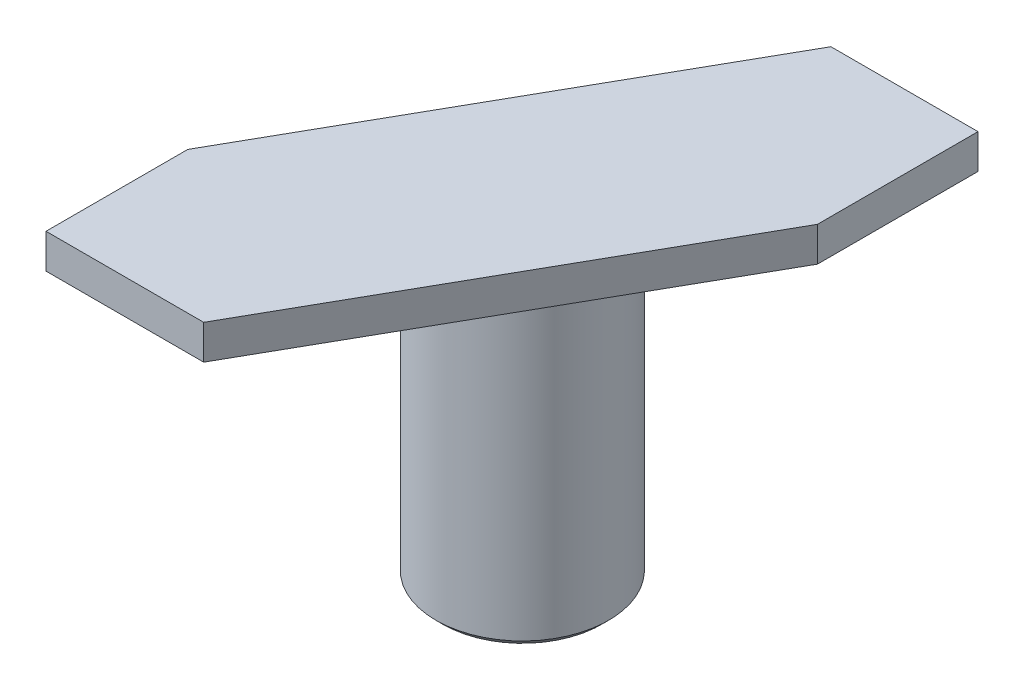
ISO-10303-21;
HEADER;
FILE_DESCRIPTION(('STEP AP214'),'2;1');
FILE_NAME('part.step','',(''),(''),'','','');
FILE_SCHEMA(('AUTOMOTIVE_DESIGN { 1 0 10303 214 1 1 1 1 }'));
ENDSEC;
DATA;
#1=APPLICATION_CONTEXT('core data for automotive mechanical design processes');
#2=APPLICATION_PROTOCOL_DEFINITION('international standard','automotive_design',2000,#1);
#3=PRODUCT_CONTEXT('',#1,'mechanical');
#4=PRODUCT('Part','Part','',(#3));
#5=PRODUCT_RELATED_PRODUCT_CATEGORY('part','',(#4));
#6=PRODUCT_DEFINITION_FORMATION('','',#4);
#7=PRODUCT_DEFINITION_CONTEXT('part definition',#1,'design');
#8=PRODUCT_DEFINITION('design','',#6,#7);
#9=PRODUCT_DEFINITION_SHAPE('','',#8);
#10=(LENGTH_UNIT() NAMED_UNIT(*) SI_UNIT(.MILLI.,.METRE.));
#11=(NAMED_UNIT(*) PLANE_ANGLE_UNIT() SI_UNIT($,.RADIAN.));
#12=(NAMED_UNIT(*) SI_UNIT($,.STERADIAN.) SOLID_ANGLE_UNIT());
#13=UNCERTAINTY_MEASURE_WITH_UNIT(LENGTH_MEASURE(1.E-05),#10,'distance_accuracy_value','');
#14=(GEOMETRIC_REPRESENTATION_CONTEXT(3) GLOBAL_UNCERTAINTY_ASSIGNED_CONTEXT((#13)) GLOBAL_UNIT_ASSIGNED_CONTEXT((#10,
#11,#12)) REPRESENTATION_CONTEXT('',''));
#15=CARTESIAN_POINT('',(0.,0.,0.));
#16=DIRECTION('',(0.,0.,1.));
#17=DIRECTION('',(1.,0.,0.));
#18=AXIS2_PLACEMENT_3D('',#15,#16,#17);
#19=CARTESIAN_POINT('',(-5.61205530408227,1.,7.24112996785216));
#20=DIRECTION('',(0.870010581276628,0.,0.493033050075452));
#21=DIRECTION('',(0.493033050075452,0.,-0.870010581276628));
#22=AXIS2_PLACEMENT_3D('',#19,#20,#21);
#23=PLANE('',#22);
#24=DIRECTION('',(-0.493033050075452,0.,0.870010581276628));
#25=VECTOR('',#24,1.);
#26=CARTESIAN_POINT('',(-5.61205530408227,0.,7.24112996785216));
#27=LINE('',#26,#25);
#28=CARTESIAN_POINT('',(1.1272308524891,0.,-4.6510753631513));
#29=VERTEX_POINT('',#28);
#30=CARTESIAN_POINT('',(-5.61205530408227,0.,7.24112996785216));
#31=VERTEX_POINT('',#30);
#32=EDGE_CURVE('E145',#29,#31,#27,.T.);
#33=ORIENTED_EDGE('',*,*,#32,.T.);
#34=DIRECTION('',(0.,-1.,0.));
#35=VECTOR('',#34,1.);
#36=CARTESIAN_POINT('',(-5.61205530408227,1.,7.24112996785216));
#37=LINE('',#36,#35);
#38=CARTESIAN_POINT('',(-5.61205530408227,1.,7.24112996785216));
#39=VERTEX_POINT('',#38);
#40=EDGE_CURVE('E174',#39,#31,#37,.T.);
#41=ORIENTED_EDGE('',*,*,#40,.F.);
#42=DIRECTION('',(-0.493033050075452,0.,0.870010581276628));
#43=VECTOR('',#42,1.);
#44=CARTESIAN_POINT('',(-5.61205530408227,1.,7.24112996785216));
#45=LINE('',#44,#43);
#46=CARTESIAN_POINT('',(1.1272308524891,1.,-4.6510753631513));
#47=VERTEX_POINT('',#46);
#48=EDGE_CURVE('E163',#47,#39,#45,.T.);
#49=ORIENTED_EDGE('',*,*,#48,.F.);
#50=DIRECTION('',(0.,-1.,0.));
#51=VECTOR('',#50,1.);
#52=CARTESIAN_POINT('',(1.1272308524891,1.,-4.6510753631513));
#53=LINE('',#52,#51);
#54=EDGE_CURVE('E141',#47,#29,#53,.T.);
#55=ORIENTED_EDGE('',*,*,#54,.T.);
#56=EDGE_LOOP('',(#33,#41,#49,#55));
#57=FACE_BOUND('',#56,.T.);
#58=ADVANCED_FACE('F41',(#57),#23,.F.);
#59=CARTESIAN_POINT('',(-5.61205530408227,1.,11.3489246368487));
#60=DIRECTION('',(1.,0.,0.));
#61=DIRECTION('',(0.,0.,-1.));
#62=AXIS2_PLACEMENT_3D('',#59,#60,#61);
#63=PLANE('',#62);
#64=DIRECTION('',(0.,0.,1.));
#65=VECTOR('',#64,1.);
#66=CARTESIAN_POINT('',(-5.61205530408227,0.,11.3489246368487));
#67=LINE('',#66,#65);
#68=CARTESIAN_POINT('',(-5.61205530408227,0.,11.3489246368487));
#69=VERTEX_POINT('',#68);
#70=EDGE_CURVE('E149',#31,#69,#67,.T.);
#71=ORIENTED_EDGE('',*,*,#70,.T.);
#72=DIRECTION('',(0.,-1.,0.));
#73=VECTOR('',#72,1.);
#74=CARTESIAN_POINT('',(-5.61205530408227,1.,11.3489246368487));
#75=LINE('',#74,#73);
#76=CARTESIAN_POINT('',(-5.61205530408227,1.,11.3489246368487));
#77=VERTEX_POINT('',#76);
#78=EDGE_CURVE('E170',#77,#69,#75,.T.);
#79=ORIENTED_EDGE('',*,*,#78,.F.);
#80=DIRECTION('',(0.,0.,1.));
#81=VECTOR('',#80,1.);
#82=CARTESIAN_POINT('',(-5.61205530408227,1.,11.3489246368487));
#83=LINE('',#82,#81);
#84=EDGE_CURVE('E103',#39,#77,#83,.T.);
#85=ORIENTED_EDGE('',*,*,#84,.F.);
#86=ORIENTED_EDGE('',*,*,#40,.T.);
#87=EDGE_LOOP('',(#71,#79,#85,#86));
#88=FACE_BOUND('',#87,.T.);
#89=ADVANCED_FACE('F194',(#88),#63,.F.);
#90=CARTESIAN_POINT('',(-1.04346550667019,1.,11.3489246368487));
#91=DIRECTION('',(0.,0.,-1.));
#92=DIRECTION('',(-1.,0.,0.));
#93=AXIS2_PLACEMENT_3D('',#90,#91,#92);
#94=PLANE('',#93);
#95=DIRECTION('',(1.,0.,0.));
#96=VECTOR('',#95,1.);
#97=CARTESIAN_POINT('',(-1.04346550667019,0.,11.3489246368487));
#98=LINE('',#97,#96);
#99=CARTESIAN_POINT('',(-1.04346550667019,0.,11.3489246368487));
#100=VERTEX_POINT('',#99);
#101=EDGE_CURVE('E153',#69,#100,#98,.T.);
#102=ORIENTED_EDGE('',*,*,#101,.T.);
#103=DIRECTION('',(0.,-1.,0.));
#104=VECTOR('',#103,1.);
#105=CARTESIAN_POINT('',(-1.04346550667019,1.,11.3489246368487));
#106=LINE('',#105,#104);
#107=CARTESIAN_POINT('',(-1.04346550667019,1.,11.3489246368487));
#108=VERTEX_POINT('',#107);
#109=EDGE_CURVE('E134',#108,#100,#106,.T.);
#110=ORIENTED_EDGE('',*,*,#109,.F.);
#111=DIRECTION('',(1.,0.,0.));
#112=VECTOR('',#111,1.);
#113=CARTESIAN_POINT('',(-1.04346550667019,1.,11.3489246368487));
#114=LINE('',#113,#112);
#115=EDGE_CURVE('E120',#77,#108,#114,.T.);
#116=ORIENTED_EDGE('',*,*,#115,.F.);
#117=ORIENTED_EDGE('',*,*,#78,.T.);
#118=EDGE_LOOP('',(#102,#110,#116,#117));
#119=FACE_BOUND('',#118,.T.);
#120=ADVANCED_FACE('F199',(#119),#94,.F.);
#121=CARTESIAN_POINT('',(5.38794469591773,1.,0.));
#122=DIRECTION('',(-0.870010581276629,0.,-0.493033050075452));
#123=DIRECTION('',(-0.493033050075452,0.,0.870010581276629));
#124=AXIS2_PLACEMENT_3D('',#121,#122,#123);
#125=PLANE('',#124);
#126=DIRECTION('',(0.493033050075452,0.,-0.870010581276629));
#127=VECTOR('',#126,1.);
#128=CARTESIAN_POINT('',(5.38794469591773,0.,0.));
#129=LINE('',#128,#127);
#130=CARTESIAN_POINT('',(5.38794469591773,0.,0.));
#131=VERTEX_POINT('',#130);
#132=EDGE_CURVE('E130',#100,#131,#129,.T.);
#133=ORIENTED_EDGE('',*,*,#132,.T.);
#134=DIRECTION('',(0.,-1.,0.));
#135=VECTOR('',#134,1.);
#136=CARTESIAN_POINT('',(5.38794469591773,1.,0.));
#137=LINE('',#136,#135);
#138=CARTESIAN_POINT('',(5.38794469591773,1.,0.));
#139=VERTEX_POINT('',#138);
#140=EDGE_CURVE('E127',#139,#131,#137,.T.);
#141=ORIENTED_EDGE('',*,*,#140,.F.);
#142=DIRECTION('',(0.493033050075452,0.,-0.870010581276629));
#143=VECTOR('',#142,1.);
#144=CARTESIAN_POINT('',(5.38794469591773,1.,0.));
#145=LINE('',#144,#143);
#146=EDGE_CURVE('E113',#108,#139,#145,.T.);
#147=ORIENTED_EDGE('',*,*,#146,.F.);
#148=ORIENTED_EDGE('',*,*,#109,.T.);
#149=EDGE_LOOP('',(#133,#141,#147,#148));
#150=FACE_BOUND('',#149,.T.);
#151=ADVANCED_FACE('F128',(#150),#125,.F.);
#152=CARTESIAN_POINT('',(5.38794469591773,1.,-4.6510753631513));
#153=DIRECTION('',(-1.,0.,0.));
#154=DIRECTION('',(0.,0.,1.));
#155=AXIS2_PLACEMENT_3D('',#152,#153,#154);
#156=PLANE('',#155);
#157=DIRECTION('',(0.,0.,-1.));
#158=VECTOR('',#157,1.);
#159=CARTESIAN_POINT('',(5.38794469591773,0.,-4.6510753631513));
#160=LINE('',#159,#158);
#161=CARTESIAN_POINT('',(5.38794469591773,0.,-4.6510753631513));
#162=VERTEX_POINT('',#161);
#163=EDGE_CURVE('E158',#131,#162,#160,.T.);
#164=ORIENTED_EDGE('',*,*,#163,.T.);
#165=DIRECTION('',(0.,-1.,0.));
#166=VECTOR('',#165,1.);
#167=CARTESIAN_POINT('',(5.38794469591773,1.,-4.6510753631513));
#168=LINE('',#167,#166);
#169=CARTESIAN_POINT('',(5.38794469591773,1.,-4.6510753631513));
#170=VERTEX_POINT('',#169);
#171=EDGE_CURVE('E135',#170,#162,#168,.T.);
#172=ORIENTED_EDGE('',*,*,#171,.F.);
#173=DIRECTION('',(0.,0.,-1.));
#174=VECTOR('',#173,1.);
#175=CARTESIAN_POINT('',(5.38794469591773,1.,-4.6510753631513));
#176=LINE('',#175,#174);
#177=EDGE_CURVE('E117',#139,#170,#176,.T.);
#178=ORIENTED_EDGE('',*,*,#177,.F.);
#179=ORIENTED_EDGE('',*,*,#140,.T.);
#180=EDGE_LOOP('',(#164,#172,#178,#179));
#181=FACE_BOUND('',#180,.T.);
#182=ADVANCED_FACE('F137',(#181),#156,.F.);
#183=CARTESIAN_POINT('',(1.1272308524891,1.,-4.6510753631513));
#184=DIRECTION('',(0.,0.,1.));
#185=DIRECTION('',(1.,0.,0.));
#186=AXIS2_PLACEMENT_3D('',#183,#184,#185);
#187=PLANE('',#186);
#188=DIRECTION('',(-1.,0.,0.));
#189=VECTOR('',#188,1.);
#190=CARTESIAN_POINT('',(1.1272308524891,0.,-4.6510753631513));
#191=LINE('',#190,#189);
#192=EDGE_CURVE('E94',#162,#29,#191,.T.);
#193=ORIENTED_EDGE('',*,*,#192,.T.);
#194=ORIENTED_EDGE('',*,*,#54,.F.);
#195=DIRECTION('',(-1.,0.,0.));
#196=VECTOR('',#195,1.);
#197=CARTESIAN_POINT('',(1.1272308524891,1.,-4.6510753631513));
#198=LINE('',#197,#196);
#199=EDGE_CURVE('E67',#170,#47,#198,.T.);
#200=ORIENTED_EDGE('',*,*,#199,.F.);
#201=ORIENTED_EDGE('',*,*,#171,.T.);
#202=EDGE_LOOP('',(#193,#194,#200,#201));
#203=FACE_BOUND('',#202,.T.);
#204=ADVANCED_FACE('F209',(#203),#187,.F.);
#205=CARTESIAN_POINT('',(0.,1.,0.));
#206=DIRECTION('',(0.,-1.,0.));
#207=DIRECTION('',(0.,0.,-1.));
#208=AXIS2_PLACEMENT_3D('',#205,#206,#207);
#209=PLANE('',#208);
#210=ORIENTED_EDGE('',*,*,#48,.T.);
#211=ORIENTED_EDGE('',*,*,#84,.T.);
#212=ORIENTED_EDGE('',*,*,#115,.T.);
#213=ORIENTED_EDGE('',*,*,#146,.T.);
#214=ORIENTED_EDGE('',*,*,#177,.T.);
#215=ORIENTED_EDGE('',*,*,#199,.T.);
#216=EDGE_LOOP('',(#210,#211,#212,#213,#214,#215));
#217=FACE_BOUND('',#216,.T.);
#218=ADVANCED_FACE('F115',(#217),#209,.F.);
#219=CARTESIAN_POINT('',(0.,0.,0.));
#220=DIRECTION('',(0.,-1.,0.));
#221=DIRECTION('',(0.,0.,-1.));
#222=AXIS2_PLACEMENT_3D('',#219,#220,#221);
#223=PLANE('',#222);
#224=CARTESIAN_POINT('',(0.,0.,3.16189984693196));
#225=DIRECTION('',(0.,1.,0.));
#226=DIRECTION('',(0.,0.,1.));
#227=AXIS2_PLACEMENT_3D('',#224,#225,#226);
#228=CIRCLE('',#227,2.5);
#229=CARTESIAN_POINT('',(0.,0.,5.66189984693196));
#230=VERTEX_POINT('',#229);
#231=EDGE_CURVE('E150',#230,#230,#228,.T.);
#232=ORIENTED_EDGE('',*,*,#231,.T.);
#233=EDGE_LOOP('',(#232));
#234=FACE_BOUND('',#233,.T.);
#235=ORIENTED_EDGE('',*,*,#32,.F.);
#236=ORIENTED_EDGE('',*,*,#192,.F.);
#237=ORIENTED_EDGE('',*,*,#163,.F.);
#238=ORIENTED_EDGE('',*,*,#132,.F.);
#239=ORIENTED_EDGE('',*,*,#101,.F.);
#240=ORIENTED_EDGE('',*,*,#70,.F.);
#241=EDGE_LOOP('',(#235,#236,#237,#238,#239,#240));
#242=FACE_BOUND('',#241,.T.);
#243=ADVANCED_FACE('F212',(#234,#242),#223,.T.);
#244=CARTESIAN_POINT('',(0.,-9.,3.16189984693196));
#245=DIRECTION('',(0.,1.,0.));
#246=DIRECTION('',(0.,0.,1.));
#247=AXIS2_PLACEMENT_3D('',#244,#245,#246);
#248=CYLINDRICAL_SURFACE('',#247,2.5);
#249=CARTESIAN_POINT('',(0.,-8.8,3.16189984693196));
#250=DIRECTION('',(0.,1.,0.));
#251=DIRECTION('',(0.,0.,1.));
#252=AXIS2_PLACEMENT_3D('',#249,#250,#251);
#253=CIRCLE('',#252,2.5);
#254=CARTESIAN_POINT('',(0.,-8.8,5.66189984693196));
#255=VERTEX_POINT('',#254);
#256=EDGE_CURVE('E51',#255,#255,#253,.T.);
#257=ORIENTED_EDGE('',*,*,#256,.T.);
#258=EDGE_LOOP('',(#257));
#259=FACE_BOUND('',#258,.T.);
#260=ORIENTED_EDGE('',*,*,#231,.F.);
#261=EDGE_LOOP('',(#260));
#262=FACE_BOUND('',#261,.T.);
#263=ADVANCED_FACE('F180',(#259,#262),#248,.T.);
#264=CARTESIAN_POINT('',(0.,-9.,3.16189984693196));
#265=DIRECTION('',(0.,1.,0.));
#266=DIRECTION('',(0.,0.,1.));
#267=AXIS2_PLACEMENT_3D('',#264,#265,#266);
#268=PLANE('',#267);
#269=CARTESIAN_POINT('',(0.,-9.,3.16189984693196));
#270=DIRECTION('',(0.,1.,0.));
#271=DIRECTION('',(0.,0.,1.));
#272=AXIS2_PLACEMENT_3D('',#269,#270,#271);
#273=CIRCLE('',#272,2.3);
#274=CARTESIAN_POINT('',(0.,-9.,5.46189984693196));
#275=VERTEX_POINT('',#274);
#276=EDGE_CURVE('E11',#275,#275,#273,.F.);
#277=ORIENTED_EDGE('',*,*,#276,.T.);
#278=EDGE_LOOP('',(#277));
#279=FACE_BOUND('',#278,.T.);
#280=DIRECTION('',(0.519946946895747,0.,-0.854198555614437));
#281=VECTOR('',#280,1.);
#282=CARTESIAN_POINT('',(-1.45660838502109,-9.,1.78181891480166));
#283=LINE('',#282,#281);
#284=CARTESIAN_POINT('',(-1.89673805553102,-9.,2.50488908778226));
#285=VERTEX_POINT('',#284);
#286=CARTESIAN_POINT('',(-1.45660838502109,-9.,1.78181891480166));
#287=VERTEX_POINT('',#286);
#288=EDGE_CURVE('E260',#285,#287,#283,.T.);
#289=ORIENTED_EDGE('',*,*,#288,.F.);
#290=DIRECTION('',(-0.854198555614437,0.,-0.519946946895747));
#291=VECTOR('',#290,1.);
#292=CARTESIAN_POINT('',(-1.89673805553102,-9.,2.50488908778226));
#293=LINE('',#292,#291);
#294=CARTESIAN_POINT('',(1.46304932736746,-9.,4.54997705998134));
#295=VERTEX_POINT('',#294);
#296=EDGE_CURVE('E58',#295,#285,#293,.T.);
#297=ORIENTED_EDGE('',*,*,#296,.F.);
#298=DIRECTION('',(-0.519946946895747,0.,0.854198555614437));
#299=VECTOR('',#298,1.);
#300=CARTESIAN_POINT('',(1.46304932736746,-9.,4.54997705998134));
#301=LINE('',#300,#299);
#302=CARTESIAN_POINT('',(1.90317899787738,-9.,3.82690688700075));
#303=VERTEX_POINT('',#302);
#304=EDGE_CURVE('E243',#303,#295,#301,.T.);
#305=ORIENTED_EDGE('',*,*,#304,.F.);
#306=DIRECTION('',(0.854198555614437,0.,0.519946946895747));
#307=VECTOR('',#306,1.);
#308=CARTESIAN_POINT('',(1.90317899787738,-9.,3.82690688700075));
#309=LINE('',#308,#307);
#310=EDGE_CURVE('E256',#287,#303,#309,.T.);
#311=ORIENTED_EDGE('',*,*,#310,.F.);
#312=EDGE_LOOP('',(#289,#297,#305,#311));
#313=FACE_BOUND('',#312,.T.);
#314=ADVANCED_FACE('F220',(#279,#313),#268,.F.);
#315=CARTESIAN_POINT('',(-1.89673805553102,-8.,2.50488908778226));
#316=DIRECTION('',(-0.519946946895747,0.,0.854198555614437));
#317=DIRECTION('',(0.854198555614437,0.,0.519946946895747));
#318=AXIS2_PLACEMENT_3D('',#315,#316,#317);
#319=PLANE('',#318);
#320=ORIENTED_EDGE('',*,*,#296,.T.);
#321=DIRECTION('',(0.,-1.,0.));
#322=VECTOR('',#321,1.);
#323=CARTESIAN_POINT('',(-1.89673805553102,-8.,2.50488908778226));
#324=LINE('',#323,#322);
#325=CARTESIAN_POINT('',(-1.89673805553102,-8.,2.50488908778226));
#326=VERTEX_POINT('',#325);
#327=EDGE_CURVE('E279',#326,#285,#324,.T.);
#328=ORIENTED_EDGE('',*,*,#327,.F.);
#329=DIRECTION('',(-0.854198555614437,0.,-0.519946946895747));
#330=VECTOR('',#329,1.);
#331=CARTESIAN_POINT('',(-1.89673805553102,-8.,2.50488908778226));
#332=LINE('',#331,#330);
#333=CARTESIAN_POINT('',(1.46304932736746,-8.,4.54997705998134));
#334=VERTEX_POINT('',#333);
#335=EDGE_CURVE('E255',#334,#326,#332,.T.);
#336=ORIENTED_EDGE('',*,*,#335,.F.);
#337=DIRECTION('',(0.,-1.,0.));
#338=VECTOR('',#337,1.);
#339=CARTESIAN_POINT('',(1.46304932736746,-8.,4.54997705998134));
#340=LINE('',#339,#338);
#341=EDGE_CURVE('E245',#334,#295,#340,.T.);
#342=ORIENTED_EDGE('',*,*,#341,.T.);
#343=EDGE_LOOP('',(#320,#328,#336,#342));
#344=FACE_BOUND('',#343,.T.);
#345=ADVANCED_FACE('F223',(#344),#319,.F.);
#346=CARTESIAN_POINT('',(1.46304932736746,-8.,4.54997705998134));
#347=DIRECTION('',(0.854198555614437,0.,0.519946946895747));
#348=DIRECTION('',(0.519946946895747,0.,-0.854198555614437));
#349=AXIS2_PLACEMENT_3D('',#346,#347,#348);
#350=PLANE('',#349);
#351=ORIENTED_EDGE('',*,*,#304,.T.);
#352=ORIENTED_EDGE('',*,*,#341,.F.);
#353=DIRECTION('',(-0.519946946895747,0.,0.854198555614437));
#354=VECTOR('',#353,1.);
#355=CARTESIAN_POINT('',(1.46304932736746,-8.,4.54997705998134));
#356=LINE('',#355,#354);
#357=CARTESIAN_POINT('',(1.90317899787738,-8.,3.82690688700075));
#358=VERTEX_POINT('',#357);
#359=EDGE_CURVE('E266',#358,#334,#356,.T.);
#360=ORIENTED_EDGE('',*,*,#359,.F.);
#361=DIRECTION('',(0.,-1.,0.));
#362=VECTOR('',#361,1.);
#363=CARTESIAN_POINT('',(1.90317899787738,-8.,3.82690688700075));
#364=LINE('',#363,#362);
#365=EDGE_CURVE('E249',#358,#303,#364,.T.);
#366=ORIENTED_EDGE('',*,*,#365,.T.);
#367=EDGE_LOOP('',(#351,#352,#360,#366));
#368=FACE_BOUND('',#367,.T.);
#369=ADVANCED_FACE('F227',(#368),#350,.F.);
#370=CARTESIAN_POINT('',(1.90317899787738,-8.,3.82690688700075));
#371=DIRECTION('',(0.519946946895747,0.,-0.854198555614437));
#372=DIRECTION('',(-0.854198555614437,0.,-0.519946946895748));
#373=AXIS2_PLACEMENT_3D('',#370,#371,#372);
#374=PLANE('',#373);
#375=ORIENTED_EDGE('',*,*,#310,.T.);
#376=ORIENTED_EDGE('',*,*,#365,.F.);
#377=DIRECTION('',(0.854198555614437,0.,0.519946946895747));
#378=VECTOR('',#377,1.);
#379=CARTESIAN_POINT('',(1.90317899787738,-8.,3.82690688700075));
#380=LINE('',#379,#378);
#381=CARTESIAN_POINT('',(-1.45660838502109,-8.,1.78181891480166));
#382=VERTEX_POINT('',#381);
#383=EDGE_CURVE('E292',#382,#358,#380,.T.);
#384=ORIENTED_EDGE('',*,*,#383,.F.);
#385=DIRECTION('',(0.,-1.,0.));
#386=VECTOR('',#385,1.);
#387=CARTESIAN_POINT('',(-1.45660838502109,-8.,1.78181891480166));
#388=LINE('',#387,#386);
#389=EDGE_CURVE('E275',#382,#287,#388,.T.);
#390=ORIENTED_EDGE('',*,*,#389,.T.);
#391=EDGE_LOOP('',(#375,#376,#384,#390));
#392=FACE_BOUND('',#391,.T.);
#393=ADVANCED_FACE('F230',(#392),#374,.F.);
#394=CARTESIAN_POINT('',(-1.45660838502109,-8.,1.78181891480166));
#395=DIRECTION('',(-0.854198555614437,0.,-0.519946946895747));
#396=DIRECTION('',(-0.519946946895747,0.,0.854198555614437));
#397=AXIS2_PLACEMENT_3D('',#394,#395,#396);
#398=PLANE('',#397);
#399=ORIENTED_EDGE('',*,*,#288,.T.);
#400=ORIENTED_EDGE('',*,*,#389,.F.);
#401=DIRECTION('',(0.519946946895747,0.,-0.854198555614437));
#402=VECTOR('',#401,1.);
#403=CARTESIAN_POINT('',(-1.45660838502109,-8.,1.78181891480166));
#404=LINE('',#403,#402);
#405=EDGE_CURVE('E295',#326,#382,#404,.T.);
#406=ORIENTED_EDGE('',*,*,#405,.F.);
#407=ORIENTED_EDGE('',*,*,#327,.T.);
#408=EDGE_LOOP('',(#399,#400,#406,#407));
#409=FACE_BOUND('',#408,.T.);
#410=ADVANCED_FACE('F189',(#409),#398,.F.);
#411=CARTESIAN_POINT('',(0.,-8.,0.));
#412=DIRECTION('',(0.,1.,0.));
#413=DIRECTION('',(0.,0.,1.));
#414=AXIS2_PLACEMENT_3D('',#411,#412,#413);
#415=PLANE('',#414);
#416=ORIENTED_EDGE('',*,*,#335,.T.);
#417=ORIENTED_EDGE('',*,*,#405,.T.);
#418=ORIENTED_EDGE('',*,*,#383,.T.);
#419=ORIENTED_EDGE('',*,*,#359,.T.);
#420=EDGE_LOOP('',(#416,#417,#418,#419));
#421=FACE_BOUND('',#420,.T.);
#422=ADVANCED_FACE('F184',(#421),#415,.F.);
#423=CARTESIAN_POINT('',(0.,-8.8,3.16189984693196));
#424=DIRECTION('',(0.,1.,0.));
#425=DIRECTION('',(0.,0.,1.));
#426=AXIS2_PLACEMENT_3D('',#423,#424,#425);
#427=CONICAL_SURFACE('',#426,2.5,0.785398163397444);
#428=ORIENTED_EDGE('',*,*,#276,.F.);
#429=EDGE_LOOP('',(#428));
#430=FACE_BOUND('',#429,.T.);
#431=ORIENTED_EDGE('',*,*,#256,.F.);
#432=EDGE_LOOP('',(#431));
#433=FACE_BOUND('',#432,.T.);
#434=ADVANCED_FACE('F44',(#430,#433),#427,.T.);
#435=CLOSED_SHELL('',(#58,#89,#120,#151,#182,#204,#218,#243,#263,#314,#345,#369,#393,#410,#422,#434));
#436=MANIFOLD_SOLID_BREP('B2',#435);
#437=ADVANCED_BREP_SHAPE_REPRESENTATION('',(#18,#436),#14);
#438=SHAPE_DEFINITION_REPRESENTATION(#9,#437);
ENDSEC;
END-ISO-10303-21;
